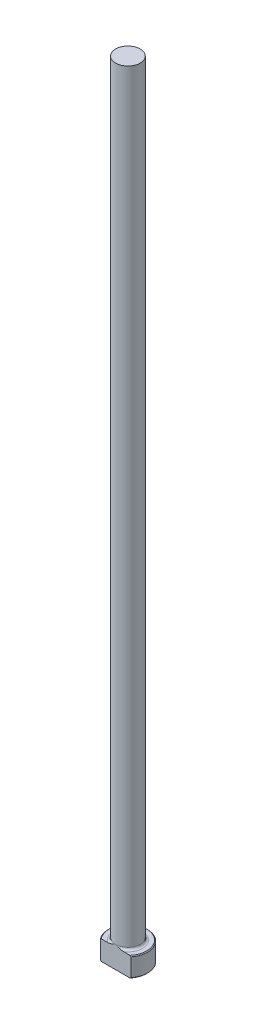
from build123d import *

# Parameters (mm, degrees)
CHAMFER1_SIZE = 0.254
FILLET1_R     = 0.762
KEY_DEPTH     = 255.158700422


with BuildPart() as part:
    # Sketch1 → Revolve1 (revolve)
    with BuildSketch(Plane.XY, mode=Mode.PRIVATE) as revolve1_sk:
        Polygon((0, 0), (-6.35, 0), (-6.35, 6.35), (-3.96875, 6.35), (-3.96875, 254), (0, 254), align=None)
    revolve(revolve1_sk.sketch.rotate(Axis((0, 259.958771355, 0), (0, -1, 0)), 270), axis=Axis((0, 259.958771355, 0), (0, -1, 0)))

    # Chamfer1
    chamfer1_edges = [part.edges().sort_by_distance(p)[0] for p in [
        (0, 6.35, -6.35),
        (0, 0, -6.35),
    ]]
    chamfer(chamfer1_edges, length=CHAMFER1_SIZE)

    # Fillet1
    fillet1_edges = [part.edges().sort_by_distance(p)[0] for p in [
        (0, 6.35, -3.96875),
    ]]
    fillet(fillet1_edges, radius=FILLET1_R)

    # Sketch2 → KEY (cut, through all)
    with BuildSketch(Plane.XZ):
        with BuildLine():
            Line((-4.956967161, 3.96875), (4.956967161, 3.96875))
            ThreePointArc((4.956967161, 3.96875), (0, 6.35), (-4.956967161, 3.96875))
        make_face()
    extrude(amount=-KEY_DEPTH, mode=Mode.SUBTRACT)


solid = part.part
